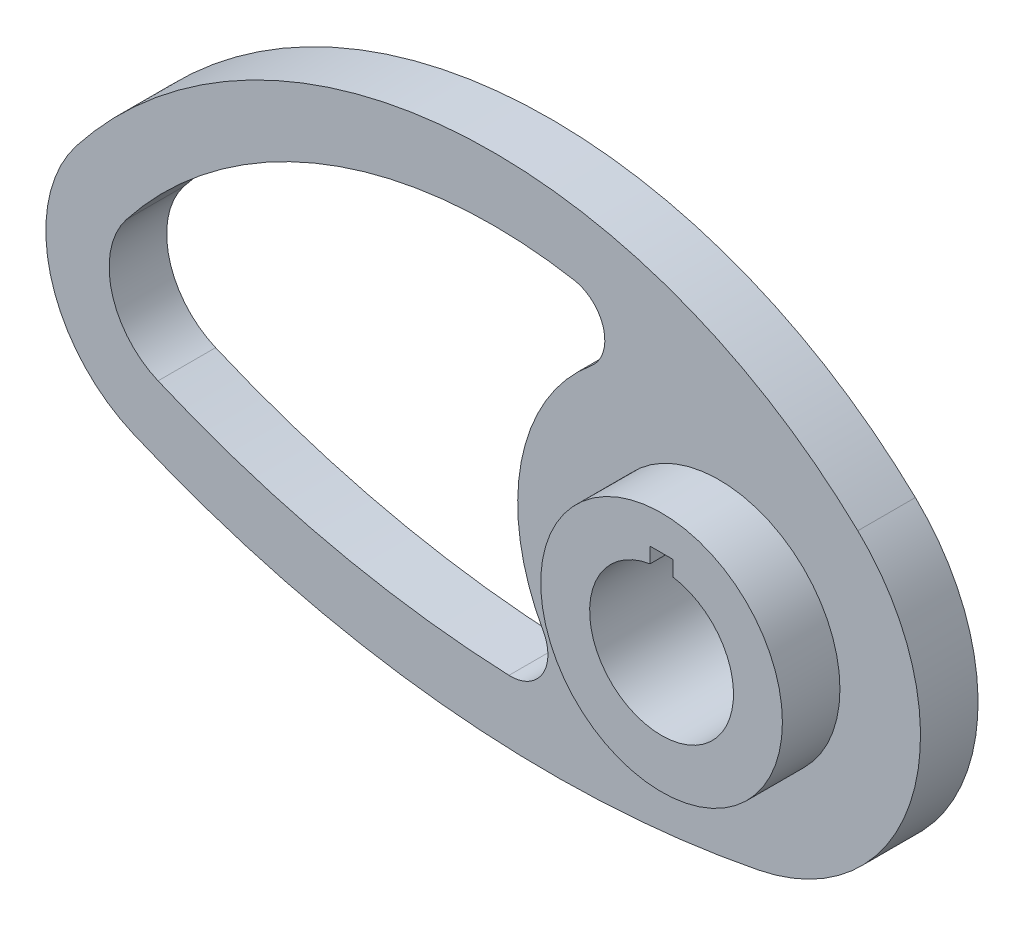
ISO-10303-21;
HEADER;
FILE_DESCRIPTION(('STEP AP214'),'2;1');
FILE_NAME('part.step','',(''),(''),'','','');
FILE_SCHEMA(('AUTOMOTIVE_DESIGN { 1 0 10303 214 1 1 1 1 }'));
ENDSEC;
DATA;
#1=APPLICATION_CONTEXT('core data for automotive mechanical design processes');
#2=APPLICATION_PROTOCOL_DEFINITION('international standard','automotive_design',2000,#1);
#3=PRODUCT_CONTEXT('',#1,'mechanical');
#4=PRODUCT('Part','Part','',(#3));
#5=PRODUCT_RELATED_PRODUCT_CATEGORY('part','',(#4));
#6=PRODUCT_DEFINITION_FORMATION('','',#4);
#7=PRODUCT_DEFINITION_CONTEXT('part definition',#1,'design');
#8=PRODUCT_DEFINITION('design','',#6,#7);
#9=PRODUCT_DEFINITION_SHAPE('','',#8);
#10=(LENGTH_UNIT() NAMED_UNIT(*) SI_UNIT(.MILLI.,.METRE.));
#11=(NAMED_UNIT(*) PLANE_ANGLE_UNIT() SI_UNIT($,.RADIAN.));
#12=(NAMED_UNIT(*) SI_UNIT($,.STERADIAN.) SOLID_ANGLE_UNIT());
#13=UNCERTAINTY_MEASURE_WITH_UNIT(LENGTH_MEASURE(1.E-05),#10,'distance_accuracy_value','');
#14=(GEOMETRIC_REPRESENTATION_CONTEXT(3) GLOBAL_UNCERTAINTY_ASSIGNED_CONTEXT((#13)) GLOBAL_UNIT_ASSIGNED_CONTEXT((#10,
#11,#12)) REPRESENTATION_CONTEXT('',''));
#15=CARTESIAN_POINT('',(0.,0.,0.));
#16=DIRECTION('',(0.,0.,1.));
#17=DIRECTION('',(1.,0.,0.));
#18=AXIS2_PLACEMENT_3D('',#15,#16,#17);
#19=CARTESIAN_POINT('',(-60.5760869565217,73.5699509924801,5.));
#20=DIRECTION('',(0.,0.,1.));
#21=DIRECTION('',(1.,0.,0.));
#22=AXIS2_PLACEMENT_3D('',#19,#20,#21);
#23=PLANE('',#22);
#24=CARTESIAN_POINT('',(-92.,0.,5.));
#25=DIRECTION('',(0.,0.,1.));
#26=DIRECTION('',(1.,0.,0.));
#27=AXIS2_PLACEMENT_3D('',#24,#25,#26);
#28=CIRCLE('',#27,25.);
#29=CARTESIAN_POINT('',(-111.678780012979,15.4190018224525,5.));
#30=VERTEX_POINT('',#29);
#31=CARTESIAN_POINT('',(-101.819972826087,-22.9906096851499,5.));
#32=VERTEX_POINT('',#31);
#33=EDGE_CURVE('E228',#30,#32,#28,.T.);
#34=ORIENTED_EDGE('',*,*,#33,.T.);
#35=CARTESIAN_POINT('',(-29.1521739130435,147.13990198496,5.));
#36=DIRECTION('',(0.,0.,1.));
#37=DIRECTION('',(1.,0.,0.));
#38=AXIS2_PLACEMENT_3D('',#35,#36,#37);
#39=CIRCLE('',#38,185.);
#40=CARTESIAN_POINT('',(6.80217391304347,-34.3326437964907,5.));
#41=VERTEX_POINT('',#40);
#42=EDGE_CURVE('E231',#32,#41,#39,.T.);
#43=ORIENTED_EDGE('',*,*,#42,.T.);
#44=CARTESIAN_POINT('',(0.,0.,5.));
#45=DIRECTION('',(0.,0.,1.));
#46=DIRECTION('',(1.,0.,0.));
#47=AXIS2_PLACEMENT_3D('',#44,#45,#46);
#48=CIRCLE('',#47,35.);
#49=CARTESIAN_POINT('',(24.1075514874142,25.373725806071,5.));
#50=VERTEX_POINT('',#49);
#51=EDGE_CURVE('E233',#41,#50,#48,.T.);
#52=ORIENTED_EDGE('',*,*,#51,.T.);
#53=CARTESIAN_POINT('',(-39.2608695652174,-41.3229248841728,5.));
#54=DIRECTION('',(0.,0.,1.));
#55=DIRECTION('',(-1.,0.,0.));
#56=AXIS2_PLACEMENT_3D('',#53,#54,#55);
#57=CIRCLE('',#56,92.);
#58=EDGE_CURVE('E235',#50,#30,#57,.T.);
#59=ORIENTED_EDGE('',*,*,#58,.T.);
#60=EDGE_LOOP('',(#34,#43,#52,#59));
#61=FACE_BOUND('',#60,.T.);
#62=CARTESIAN_POINT('',(-26.3615126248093,32.0518431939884,5.));
#63=DIRECTION('',(0.,0.,1.));
#64=DIRECTION('',(-1.,0.,0.));
#65=AXIS2_PLACEMENT_3D('',#62,#63,#64);
#66=CIRCLE('',#65,6.5);
#67=CARTESIAN_POINT('',(-22.2326010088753,27.0316749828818,5.));
#68=VERTEX_POINT('',#67);
#69=CARTESIAN_POINT('',(-25.236065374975,38.453668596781,5.));
#70=VERTEX_POINT('',#69);
#71=EDGE_CURVE('E171',#68,#70,#66,.T.);
#72=ORIENTED_EDGE('',*,*,#71,.F.);
#73=CARTESIAN_POINT('',(0.,0.,5.));
#74=DIRECTION('',(0.,0.,-1.));
#75=DIRECTION('',(1.,0.,0.));
#76=AXIS2_PLACEMENT_3D('',#73,#74,#75);
#77=CIRCLE('',#76,35.);
#78=CARTESIAN_POINT('',(-30.569402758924,-17.0444012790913,5.));
#79=VERTEX_POINT('',#78);
#80=EDGE_CURVE('E185',#79,#68,#77,.T.);
#81=ORIENTED_EDGE('',*,*,#80,.F.);
#82=CARTESIAN_POINT('',(-36.2465775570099,-20.2097900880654,5.));
#83=DIRECTION('',(0.,0.,1.));
#84=DIRECTION('',(1.,0.,0.));
#85=AXIS2_PLACEMENT_3D('',#82,#83,#84);
#86=CIRCLE('',#85,6.5);
#87=CARTESIAN_POINT('',(-36.5218827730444,-26.7039572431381,5.));
#88=VERTEX_POINT('',#87);
#89=EDGE_CURVE('E182',#88,#79,#86,.T.);
#90=ORIENTED_EDGE('',*,*,#89,.F.);
#91=CARTESIAN_POINT('',(-29.1521739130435,147.13990198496,5.));
#92=DIRECTION('',(0.,0.,1.));
#93=DIRECTION('',(1.,0.,0.));
#94=AXIS2_PLACEMENT_3D('',#91,#92,#93);
#95=CIRCLE('',#94,174.);
#96=CARTESIAN_POINT('',(-97.4991847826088,-12.8747414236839,5.));
#97=VERTEX_POINT('',#96);
#98=EDGE_CURVE('E179',#97,#88,#95,.T.);
#99=ORIENTED_EDGE('',*,*,#98,.F.);
#100=CARTESIAN_POINT('',(-92.,0.,5.));
#101=DIRECTION('',(0.,0.,1.));
#102=DIRECTION('',(1.,0.,0.));
#103=AXIS2_PLACEMENT_3D('',#100,#101,#102);
#104=CIRCLE('',#103,14.);
#105=CARTESIAN_POINT('',(-103.020116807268,8.6346410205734,5.));
#106=VERTEX_POINT('',#105);
#107=EDGE_CURVE('E176',#106,#97,#104,.T.);
#108=ORIENTED_EDGE('',*,*,#107,.F.);
#109=CARTESIAN_POINT('',(-39.2608695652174,-41.3229248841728,5.));
#110=DIRECTION('',(0.,0.,1.));
#111=DIRECTION('',(1.,0.,0.));
#112=AXIS2_PLACEMENT_3D('',#109,#110,#111);
#113=CIRCLE('',#112,81.);
#114=EDGE_CURVE('E173',#70,#106,#113,.T.);
#115=ORIENTED_EDGE('',*,*,#114,.F.);
#116=EDGE_LOOP('',(#72,#81,#90,#99,#108,#115));
#117=FACE_BOUND('',#116,.T.);
#118=CARTESIAN_POINT('',(0.,0.,5.));
#119=DIRECTION('',(0.,0.,1.));
#120=DIRECTION('',(1.,0.,0.));
#121=AXIS2_PLACEMENT_3D('',#118,#119,#120);
#122=CIRCLE('',#121,21.);
#123=CARTESIAN_POINT('',(21.,0.,5.));
#124=VERTEX_POINT('',#123);
#125=EDGE_CURVE('E163',#124,#124,#122,.T.);
#126=ORIENTED_EDGE('',*,*,#125,.F.);
#127=EDGE_LOOP('',(#126));
#128=FACE_BOUND('',#127,.T.);
#129=ADVANCED_FACE('F28',(#61,#117,#128),#23,.T.);
#130=CARTESIAN_POINT('',(-92.,0.,5.));
#131=DIRECTION('',(0.,0.,-1.));
#132=DIRECTION('',(-1.,0.,0.));
#133=AXIS2_PLACEMENT_3D('',#130,#131,#132);
#134=CYLINDRICAL_SURFACE('',#133,25.);
#135=CARTESIAN_POINT('',(-92.,0.,-5.));
#136=DIRECTION('',(0.,0.,1.));
#137=DIRECTION('',(1.,0.,0.));
#138=AXIS2_PLACEMENT_3D('',#135,#136,#137);
#139=CIRCLE('',#138,25.);
#140=CARTESIAN_POINT('',(-111.678780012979,15.4190018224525,-5.));
#141=VERTEX_POINT('',#140);
#142=CARTESIAN_POINT('',(-101.819972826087,-22.9906096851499,-5.));
#143=VERTEX_POINT('',#142);
#144=EDGE_CURVE('E209',#141,#143,#139,.T.);
#145=ORIENTED_EDGE('',*,*,#144,.T.);
#146=DIRECTION('',(0.,0.,-1.));
#147=VECTOR('',#146,1.);
#148=CARTESIAN_POINT('',(-101.819972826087,-22.9906096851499,5.));
#149=LINE('',#148,#147);
#150=EDGE_CURVE('E11',#32,#143,#149,.T.);
#151=ORIENTED_EDGE('',*,*,#150,.F.);
#152=ORIENTED_EDGE('',*,*,#33,.F.);
#153=DIRECTION('',(0.,0.,-1.));
#154=VECTOR('',#153,1.);
#155=CARTESIAN_POINT('',(-111.678780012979,15.4190018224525,5.));
#156=LINE('',#155,#154);
#157=EDGE_CURVE('E237',#30,#141,#156,.T.);
#158=ORIENTED_EDGE('',*,*,#157,.T.);
#159=EDGE_LOOP('',(#145,#151,#152,#158));
#160=FACE_BOUND('',#159,.T.);
#161=ADVANCED_FACE('F30',(#160),#134,.T.);
#162=CARTESIAN_POINT('',(-29.1521739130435,147.13990198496,5.));
#163=DIRECTION('',(0.,0.,-1.));
#164=DIRECTION('',(-1.,0.,0.));
#165=AXIS2_PLACEMENT_3D('',#162,#163,#164);
#166=CYLINDRICAL_SURFACE('',#165,185.);
#167=CARTESIAN_POINT('',(-29.1521739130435,147.13990198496,-5.));
#168=DIRECTION('',(0.,0.,1.));
#169=DIRECTION('',(1.,0.,0.));
#170=AXIS2_PLACEMENT_3D('',#167,#168,#169);
#171=CIRCLE('',#170,185.);
#172=CARTESIAN_POINT('',(6.80217391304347,-34.3326437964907,-5.));
#173=VERTEX_POINT('',#172);
#174=EDGE_CURVE('E222',#143,#173,#171,.T.);
#175=ORIENTED_EDGE('',*,*,#174,.T.);
#176=DIRECTION('',(0.,0.,-1.));
#177=VECTOR('',#176,1.);
#178=CARTESIAN_POINT('',(6.80217391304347,-34.3326437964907,5.));
#179=LINE('',#178,#177);
#180=EDGE_CURVE('E36',#41,#173,#179,.T.);
#181=ORIENTED_EDGE('',*,*,#180,.F.);
#182=ORIENTED_EDGE('',*,*,#42,.F.);
#183=ORIENTED_EDGE('',*,*,#150,.T.);
#184=EDGE_LOOP('',(#175,#181,#182,#183));
#185=FACE_BOUND('',#184,.T.);
#186=ADVANCED_FACE('F263',(#185),#166,.T.);
#187=CARTESIAN_POINT('',(0.,0.,5.));
#188=DIRECTION('',(0.,0.,-1.));
#189=DIRECTION('',(-1.,0.,0.));
#190=AXIS2_PLACEMENT_3D('',#187,#188,#189);
#191=CYLINDRICAL_SURFACE('',#190,35.);
#192=CARTESIAN_POINT('',(0.,0.,-5.));
#193=DIRECTION('',(0.,0.,1.));
#194=DIRECTION('',(1.,0.,0.));
#195=AXIS2_PLACEMENT_3D('',#192,#193,#194);
#196=CIRCLE('',#195,35.);
#197=CARTESIAN_POINT('',(24.1075514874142,25.373725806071,-5.));
#198=VERTEX_POINT('',#197);
#199=EDGE_CURVE('E224',#173,#198,#196,.T.);
#200=ORIENTED_EDGE('',*,*,#199,.T.);
#201=DIRECTION('',(0.,0.,-1.));
#202=VECTOR('',#201,1.);
#203=CARTESIAN_POINT('',(24.1075514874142,25.373725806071,5.));
#204=LINE('',#203,#202);
#205=EDGE_CURVE('E240',#50,#198,#204,.T.);
#206=ORIENTED_EDGE('',*,*,#205,.F.);
#207=ORIENTED_EDGE('',*,*,#51,.F.);
#208=ORIENTED_EDGE('',*,*,#180,.T.);
#209=EDGE_LOOP('',(#200,#206,#207,#208));
#210=FACE_BOUND('',#209,.T.);
#211=ADVANCED_FACE('F247',(#210),#191,.T.);
#212=CARTESIAN_POINT('',(-39.2608695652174,-41.3229248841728,5.));
#213=DIRECTION('',(0.,0.,-1.));
#214=DIRECTION('',(-1.,0.,0.));
#215=AXIS2_PLACEMENT_3D('',#212,#213,#214);
#216=CYLINDRICAL_SURFACE('',#215,92.);
#217=CARTESIAN_POINT('',(-39.2608695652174,-41.3229248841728,-5.));
#218=DIRECTION('',(0.,0.,1.));
#219=DIRECTION('',(-1.,0.,0.));
#220=AXIS2_PLACEMENT_3D('',#217,#218,#219);
#221=CIRCLE('',#220,92.);
#222=EDGE_CURVE('E226',#198,#141,#221,.T.);
#223=ORIENTED_EDGE('',*,*,#222,.T.);
#224=ORIENTED_EDGE('',*,*,#157,.F.);
#225=ORIENTED_EDGE('',*,*,#58,.F.);
#226=ORIENTED_EDGE('',*,*,#205,.T.);
#227=EDGE_LOOP('',(#223,#224,#225,#226));
#228=FACE_BOUND('',#227,.T.);
#229=ADVANCED_FACE('F256',(#228),#216,.T.);
#230=CARTESIAN_POINT('',(-60.5760869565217,73.5699509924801,-5.));
#231=DIRECTION('',(0.,0.,1.));
#232=DIRECTION('',(1.,0.,0.));
#233=AXIS2_PLACEMENT_3D('',#230,#231,#232);
#234=PLANE('',#233);
#235=DIRECTION('',(0.,-1.,0.));
#236=VECTOR('',#235,1.);
#237=CARTESIAN_POINT('',(-2.,12.3389626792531,-5.));
#238=LINE('',#237,#236);
#239=CARTESIAN_POINT('',(-2.,15.,-5.));
#240=VERTEX_POINT('',#239);
#241=CARTESIAN_POINT('',(-2.,12.3389626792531,-5.));
#242=VERTEX_POINT('',#241);
#243=EDGE_CURVE('E158',#240,#242,#238,.T.);
#244=ORIENTED_EDGE('',*,*,#243,.T.);
#245=CARTESIAN_POINT('',(0.,0.,-5.));
#246=DIRECTION('',(0.,0.,1.));
#247=DIRECTION('',(1.,0.,0.));
#248=AXIS2_PLACEMENT_3D('',#245,#246,#247);
#249=CIRCLE('',#248,12.5);
#250=CARTESIAN_POINT('',(2.,12.3389626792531,-5.));
#251=VERTEX_POINT('',#250);
#252=EDGE_CURVE('E149',#242,#251,#249,.T.);
#253=ORIENTED_EDGE('',*,*,#252,.T.);
#254=DIRECTION('',(0.,1.,0.));
#255=VECTOR('',#254,1.);
#256=CARTESIAN_POINT('',(2.,12.3389626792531,-5.));
#257=LINE('',#256,#255);
#258=CARTESIAN_POINT('',(2.,15.,-5.));
#259=VERTEX_POINT('',#258);
#260=EDGE_CURVE('E155',#251,#259,#257,.T.);
#261=ORIENTED_EDGE('',*,*,#260,.T.);
#262=DIRECTION('',(-1.,0.,0.));
#263=VECTOR('',#262,1.);
#264=CARTESIAN_POINT('',(-2.,15.,-5.));
#265=LINE('',#264,#263);
#266=EDGE_CURVE('E43',#259,#240,#265,.T.);
#267=ORIENTED_EDGE('',*,*,#266,.T.);
#268=EDGE_LOOP('',(#244,#253,#261,#267));
#269=FACE_BOUND('',#268,.T.);
#270=CARTESIAN_POINT('',(0.,0.,-5.));
#271=DIRECTION('',(0.,0.,-1.));
#272=DIRECTION('',(1.,0.,0.));
#273=AXIS2_PLACEMENT_3D('',#270,#271,#272);
#274=CIRCLE('',#273,35.);
#275=CARTESIAN_POINT('',(-30.569402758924,-17.0444012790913,-5.));
#276=VERTEX_POINT('',#275);
#277=CARTESIAN_POINT('',(-22.2326010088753,27.0316749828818,-5.));
#278=VERTEX_POINT('',#277);
#279=EDGE_CURVE('E203',#276,#278,#274,.T.);
#280=ORIENTED_EDGE('',*,*,#279,.T.);
#281=CARTESIAN_POINT('',(-26.3615126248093,32.0518431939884,-5.));
#282=DIRECTION('',(0.,0.,1.));
#283=DIRECTION('',(-1.,0.,0.));
#284=AXIS2_PLACEMENT_3D('',#281,#282,#283);
#285=CIRCLE('',#284,6.5);
#286=CARTESIAN_POINT('',(-25.236065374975,38.453668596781,-5.));
#287=VERTEX_POINT('',#286);
#288=EDGE_CURVE('E188',#278,#287,#285,.T.);
#289=ORIENTED_EDGE('',*,*,#288,.T.);
#290=CARTESIAN_POINT('',(-39.2608695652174,-41.3229248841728,-5.));
#291=DIRECTION('',(0.,0.,1.));
#292=DIRECTION('',(1.,0.,0.));
#293=AXIS2_PLACEMENT_3D('',#290,#291,#292);
#294=CIRCLE('',#293,81.);
#295=CARTESIAN_POINT('',(-103.020116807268,8.6346410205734,-5.));
#296=VERTEX_POINT('',#295);
#297=EDGE_CURVE('E191',#287,#296,#294,.T.);
#298=ORIENTED_EDGE('',*,*,#297,.T.);
#299=CARTESIAN_POINT('',(-92.,0.,-5.));
#300=DIRECTION('',(0.,0.,1.));
#301=DIRECTION('',(1.,0.,0.));
#302=AXIS2_PLACEMENT_3D('',#299,#300,#301);
#303=CIRCLE('',#302,14.);
#304=CARTESIAN_POINT('',(-97.4991847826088,-12.8747414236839,-5.));
#305=VERTEX_POINT('',#304);
#306=EDGE_CURVE('E194',#296,#305,#303,.T.);
#307=ORIENTED_EDGE('',*,*,#306,.T.);
#308=CARTESIAN_POINT('',(-29.1521739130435,147.13990198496,-5.));
#309=DIRECTION('',(0.,0.,1.));
#310=DIRECTION('',(1.,0.,0.));
#311=AXIS2_PLACEMENT_3D('',#308,#309,#310);
#312=CIRCLE('',#311,174.);
#313=CARTESIAN_POINT('',(-36.5218827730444,-26.7039572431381,-5.));
#314=VERTEX_POINT('',#313);
#315=EDGE_CURVE('E197',#305,#314,#312,.T.);
#316=ORIENTED_EDGE('',*,*,#315,.T.);
#317=CARTESIAN_POINT('',(-36.2465775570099,-20.2097900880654,-5.));
#318=DIRECTION('',(0.,0.,1.));
#319=DIRECTION('',(1.,0.,0.));
#320=AXIS2_PLACEMENT_3D('',#317,#318,#319);
#321=CIRCLE('',#320,6.5);
#322=EDGE_CURVE('E200',#314,#276,#321,.T.);
#323=ORIENTED_EDGE('',*,*,#322,.T.);
#324=EDGE_LOOP('',(#280,#289,#298,#307,#316,#323));
#325=FACE_BOUND('',#324,.T.);
#326=ORIENTED_EDGE('',*,*,#144,.F.);
#327=ORIENTED_EDGE('',*,*,#222,.F.);
#328=ORIENTED_EDGE('',*,*,#199,.F.);
#329=ORIENTED_EDGE('',*,*,#174,.F.);
#330=EDGE_LOOP('',(#326,#327,#328,#329));
#331=FACE_BOUND('',#330,.T.);
#332=ADVANCED_FACE('F253',(#269,#325,#331),#234,.F.);
#333=CARTESIAN_POINT('',(-26.3615126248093,32.0518431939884,-5.));
#334=DIRECTION('',(0.,0.,1.));
#335=DIRECTION('',(1.,0.,0.));
#336=AXIS2_PLACEMENT_3D('',#333,#334,#335);
#337=CYLINDRICAL_SURFACE('',#336,6.5);
#338=ORIENTED_EDGE('',*,*,#71,.T.);
#339=DIRECTION('',(0.,0.,1.));
#340=VECTOR('',#339,1.);
#341=CARTESIAN_POINT('',(-25.236065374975,38.453668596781,-5.));
#342=LINE('',#341,#340);
#343=EDGE_CURVE('E206',#287,#70,#342,.T.);
#344=ORIENTED_EDGE('',*,*,#343,.F.);
#345=ORIENTED_EDGE('',*,*,#288,.F.);
#346=DIRECTION('',(0.,0.,1.));
#347=VECTOR('',#346,1.);
#348=CARTESIAN_POINT('',(-22.2326010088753,27.0316749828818,-5.));
#349=LINE('',#348,#347);
#350=EDGE_CURVE('E207',#278,#68,#349,.T.);
#351=ORIENTED_EDGE('',*,*,#350,.T.);
#352=EDGE_LOOP('',(#338,#344,#345,#351));
#353=FACE_BOUND('',#352,.T.);
#354=ADVANCED_FACE('F284',(#353),#337,.F.);
#355=CARTESIAN_POINT('',(0.,0.,-5.));
#356=DIRECTION('',(0.,0.,1.));
#357=DIRECTION('',(1.,0.,0.));
#358=AXIS2_PLACEMENT_3D('',#355,#356,#357);
#359=CYLINDRICAL_SURFACE('',#358,35.);
#360=ORIENTED_EDGE('',*,*,#80,.T.);
#361=ORIENTED_EDGE('',*,*,#350,.F.);
#362=ORIENTED_EDGE('',*,*,#279,.F.);
#363=DIRECTION('',(0.,0.,1.));
#364=VECTOR('',#363,1.);
#365=CARTESIAN_POINT('',(-30.569402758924,-17.0444012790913,-5.));
#366=LINE('',#365,#364);
#367=EDGE_CURVE('E210',#276,#79,#366,.T.);
#368=ORIENTED_EDGE('',*,*,#367,.T.);
#369=EDGE_LOOP('',(#360,#361,#362,#368));
#370=FACE_BOUND('',#369,.T.);
#371=ADVANCED_FACE('F289',(#370),#359,.T.);
#372=CARTESIAN_POINT('',(-36.2465775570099,-20.2097900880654,-5.));
#373=DIRECTION('',(0.,0.,1.));
#374=DIRECTION('',(1.,0.,0.));
#375=AXIS2_PLACEMENT_3D('',#372,#373,#374);
#376=CYLINDRICAL_SURFACE('',#375,6.5);
#377=ORIENTED_EDGE('',*,*,#89,.T.);
#378=ORIENTED_EDGE('',*,*,#367,.F.);
#379=ORIENTED_EDGE('',*,*,#322,.F.);
#380=DIRECTION('',(0.,0.,1.));
#381=VECTOR('',#380,1.);
#382=CARTESIAN_POINT('',(-36.5218827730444,-26.7039572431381,-5.));
#383=LINE('',#382,#381);
#384=EDGE_CURVE('E212',#314,#88,#383,.T.);
#385=ORIENTED_EDGE('',*,*,#384,.T.);
#386=EDGE_LOOP('',(#377,#378,#379,#385));
#387=FACE_BOUND('',#386,.T.);
#388=ADVANCED_FACE('F313',(#387),#376,.F.);
#389=CARTESIAN_POINT('',(-29.1521739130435,147.13990198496,-5.));
#390=DIRECTION('',(0.,0.,1.));
#391=DIRECTION('',(1.,0.,0.));
#392=AXIS2_PLACEMENT_3D('',#389,#390,#391);
#393=CYLINDRICAL_SURFACE('',#392,174.);
#394=ORIENTED_EDGE('',*,*,#98,.T.);
#395=ORIENTED_EDGE('',*,*,#384,.F.);
#396=ORIENTED_EDGE('',*,*,#315,.F.);
#397=DIRECTION('',(0.,0.,1.));
#398=VECTOR('',#397,1.);
#399=CARTESIAN_POINT('',(-97.4991847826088,-12.8747414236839,-5.));
#400=LINE('',#399,#398);
#401=EDGE_CURVE('E214',#305,#97,#400,.T.);
#402=ORIENTED_EDGE('',*,*,#401,.T.);
#403=EDGE_LOOP('',(#394,#395,#396,#402));
#404=FACE_BOUND('',#403,.T.);
#405=ADVANCED_FACE('F310',(#404),#393,.F.);
#406=CARTESIAN_POINT('',(-92.,0.,-5.));
#407=DIRECTION('',(0.,0.,1.));
#408=DIRECTION('',(1.,0.,0.));
#409=AXIS2_PLACEMENT_3D('',#406,#407,#408);
#410=CYLINDRICAL_SURFACE('',#409,14.);
#411=ORIENTED_EDGE('',*,*,#107,.T.);
#412=ORIENTED_EDGE('',*,*,#401,.F.);
#413=ORIENTED_EDGE('',*,*,#306,.F.);
#414=DIRECTION('',(0.,0.,1.));
#415=VECTOR('',#414,1.);
#416=CARTESIAN_POINT('',(-103.020116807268,8.6346410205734,-5.));
#417=LINE('',#416,#415);
#418=EDGE_CURVE('E216',#296,#106,#417,.T.);
#419=ORIENTED_EDGE('',*,*,#418,.T.);
#420=EDGE_LOOP('',(#411,#412,#413,#419));
#421=FACE_BOUND('',#420,.T.);
#422=ADVANCED_FACE('F306',(#421),#410,.F.);
#423=CARTESIAN_POINT('',(-39.2608695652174,-41.3229248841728,-5.));
#424=DIRECTION('',(0.,0.,1.));
#425=DIRECTION('',(1.,0.,0.));
#426=AXIS2_PLACEMENT_3D('',#423,#424,#425);
#427=CYLINDRICAL_SURFACE('',#426,81.);
#428=ORIENTED_EDGE('',*,*,#114,.T.);
#429=ORIENTED_EDGE('',*,*,#418,.F.);
#430=ORIENTED_EDGE('',*,*,#297,.F.);
#431=ORIENTED_EDGE('',*,*,#343,.T.);
#432=EDGE_LOOP('',(#428,#429,#430,#431));
#433=FACE_BOUND('',#432,.T.);
#434=ADVANCED_FACE('F303',(#433),#427,.F.);
#435=CARTESIAN_POINT('',(0.,0.,15.));
#436=DIRECTION('',(0.,0.,-1.));
#437=DIRECTION('',(-1.,0.,0.));
#438=AXIS2_PLACEMENT_3D('',#435,#436,#437);
#439=CYLINDRICAL_SURFACE('',#438,21.);
#440=CARTESIAN_POINT('',(0.,0.,15.));
#441=DIRECTION('',(0.,0.,1.));
#442=DIRECTION('',(1.,0.,0.));
#443=AXIS2_PLACEMENT_3D('',#440,#441,#442);
#444=CIRCLE('',#443,21.);
#445=CARTESIAN_POINT('',(21.,0.,15.));
#446=VERTEX_POINT('',#445);
#447=EDGE_CURVE('E168',#446,#446,#444,.T.);
#448=ORIENTED_EDGE('',*,*,#447,.F.);
#449=EDGE_LOOP('',(#448));
#450=FACE_BOUND('',#449,.T.);
#451=ORIENTED_EDGE('',*,*,#125,.T.);
#452=EDGE_LOOP('',(#451));
#453=FACE_BOUND('',#452,.T.);
#454=ADVANCED_FACE('F317',(#450,#453),#439,.T.);
#455=CARTESIAN_POINT('',(0.,0.,15.));
#456=DIRECTION('',(0.,0.,1.));
#457=DIRECTION('',(1.,0.,0.));
#458=AXIS2_PLACEMENT_3D('',#455,#456,#457);
#459=PLANE('',#458);
#460=CARTESIAN_POINT('',(0.,0.,15.));
#461=DIRECTION('',(0.,0.,1.));
#462=DIRECTION('',(1.,0.,0.));
#463=AXIS2_PLACEMENT_3D('',#460,#461,#462);
#464=CIRCLE('',#463,12.5);
#465=CARTESIAN_POINT('',(-2.,12.3389626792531,15.));
#466=VERTEX_POINT('',#465);
#467=CARTESIAN_POINT('',(2.,12.3389626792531,15.));
#468=VERTEX_POINT('',#467);
#469=EDGE_CURVE('E51',#466,#468,#464,.T.);
#470=ORIENTED_EDGE('',*,*,#469,.F.);
#471=DIRECTION('',(0.,-1.,0.));
#472=VECTOR('',#471,1.);
#473=CARTESIAN_POINT('',(-2.,12.3389626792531,15.));
#474=LINE('',#473,#472);
#475=CARTESIAN_POINT('',(-2.,15.,15.));
#476=VERTEX_POINT('',#475);
#477=EDGE_CURVE('E147',#476,#466,#474,.T.);
#478=ORIENTED_EDGE('',*,*,#477,.F.);
#479=DIRECTION('',(-1.,0.,0.));
#480=VECTOR('',#479,1.);
#481=CARTESIAN_POINT('',(-2.,15.,15.));
#482=LINE('',#481,#480);
#483=CARTESIAN_POINT('',(2.,15.,15.));
#484=VERTEX_POINT('',#483);
#485=EDGE_CURVE('E131',#484,#476,#482,.T.);
#486=ORIENTED_EDGE('',*,*,#485,.F.);
#487=DIRECTION('',(0.,1.,0.));
#488=VECTOR('',#487,1.);
#489=CARTESIAN_POINT('',(2.,12.3389626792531,15.));
#490=LINE('',#489,#488);
#491=EDGE_CURVE('E140',#468,#484,#490,.T.);
#492=ORIENTED_EDGE('',*,*,#491,.F.);
#493=EDGE_LOOP('',(#470,#478,#486,#492));
#494=FACE_BOUND('',#493,.T.);
#495=ORIENTED_EDGE('',*,*,#447,.T.);
#496=EDGE_LOOP('',(#495));
#497=FACE_BOUND('',#496,.T.);
#498=ADVANCED_FACE('F144',(#494,#497),#459,.T.);
#499=CARTESIAN_POINT('',(0.,0.,-5.));
#500=DIRECTION('',(0.,0.,1.));
#501=DIRECTION('',(1.,0.,0.));
#502=AXIS2_PLACEMENT_3D('',#499,#500,#501);
#503=CYLINDRICAL_SURFACE('',#502,12.5);
#504=ORIENTED_EDGE('',*,*,#469,.T.);
#505=DIRECTION('',(0.,0.,1.));
#506=VECTOR('',#505,1.);
#507=CARTESIAN_POINT('',(2.,12.3389626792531,-5.));
#508=LINE('',#507,#506);
#509=EDGE_CURVE('E137',#251,#468,#508,.T.);
#510=ORIENTED_EDGE('',*,*,#509,.F.);
#511=ORIENTED_EDGE('',*,*,#252,.F.);
#512=DIRECTION('',(0.,0.,1.));
#513=VECTOR('',#512,1.);
#514=CARTESIAN_POINT('',(-2.,12.3389626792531,-5.));
#515=LINE('',#514,#513);
#516=EDGE_CURVE('E161',#242,#466,#515,.T.);
#517=ORIENTED_EDGE('',*,*,#516,.T.);
#518=EDGE_LOOP('',(#504,#510,#511,#517));
#519=FACE_BOUND('',#518,.T.);
#520=ADVANCED_FACE('F322',(#519),#503,.F.);
#521=CARTESIAN_POINT('',(-2.,12.3389626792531,-5.));
#522=DIRECTION('',(-1.,0.,0.));
#523=DIRECTION('',(0.,0.,1.));
#524=AXIS2_PLACEMENT_3D('',#521,#522,#523);
#525=PLANE('',#524);
#526=ORIENTED_EDGE('',*,*,#477,.T.);
#527=ORIENTED_EDGE('',*,*,#516,.F.);
#528=ORIENTED_EDGE('',*,*,#243,.F.);
#529=DIRECTION('',(0.,0.,1.));
#530=VECTOR('',#529,1.);
#531=CARTESIAN_POINT('',(-2.,15.,-5.));
#532=LINE('',#531,#530);
#533=EDGE_CURVE('E136',#240,#476,#532,.T.);
#534=ORIENTED_EDGE('',*,*,#533,.T.);
#535=EDGE_LOOP('',(#526,#527,#528,#534));
#536=FACE_BOUND('',#535,.T.);
#537=ADVANCED_FACE('F358',(#536),#525,.F.);
#538=CARTESIAN_POINT('',(-2.,15.,-5.));
#539=DIRECTION('',(0.,1.,0.));
#540=DIRECTION('',(0.,0.,1.));
#541=AXIS2_PLACEMENT_3D('',#538,#539,#540);
#542=PLANE('',#541);
#543=ORIENTED_EDGE('',*,*,#485,.T.);
#544=ORIENTED_EDGE('',*,*,#533,.F.);
#545=ORIENTED_EDGE('',*,*,#266,.F.);
#546=DIRECTION('',(0.,0.,1.));
#547=VECTOR('',#546,1.);
#548=CARTESIAN_POINT('',(2.,15.,-5.));
#549=LINE('',#548,#547);
#550=EDGE_CURVE('E127',#259,#484,#549,.T.);
#551=ORIENTED_EDGE('',*,*,#550,.T.);
#552=EDGE_LOOP('',(#543,#544,#545,#551));
#553=FACE_BOUND('',#552,.T.);
#554=ADVANCED_FACE('F129',(#553),#542,.F.);
#555=CARTESIAN_POINT('',(2.,12.3389626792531,-5.));
#556=DIRECTION('',(1.,0.,0.));
#557=DIRECTION('',(0.,1.,0.));
#558=AXIS2_PLACEMENT_3D('',#555,#556,#557);
#559=PLANE('',#558);
#560=ORIENTED_EDGE('',*,*,#491,.T.);
#561=ORIENTED_EDGE('',*,*,#550,.F.);
#562=ORIENTED_EDGE('',*,*,#260,.F.);
#563=ORIENTED_EDGE('',*,*,#509,.T.);
#564=EDGE_LOOP('',(#560,#561,#562,#563));
#565=FACE_BOUND('',#564,.T.);
#566=ADVANCED_FACE('F141',(#565),#559,.F.);
#567=CLOSED_SHELL('',(#129,#161,#186,#211,#229,#332,#354,#371,#388,#405,#422,#434,#454,#498,
#520,#537,#554,#566));
#568=MANIFOLD_SOLID_BREP('B2',#567);
#569=ADVANCED_BREP_SHAPE_REPRESENTATION('',(#18,#568),#14);
#570=SHAPE_DEFINITION_REPRESENTATION(#9,#569);
ENDSEC;
END-ISO-10303-21;
